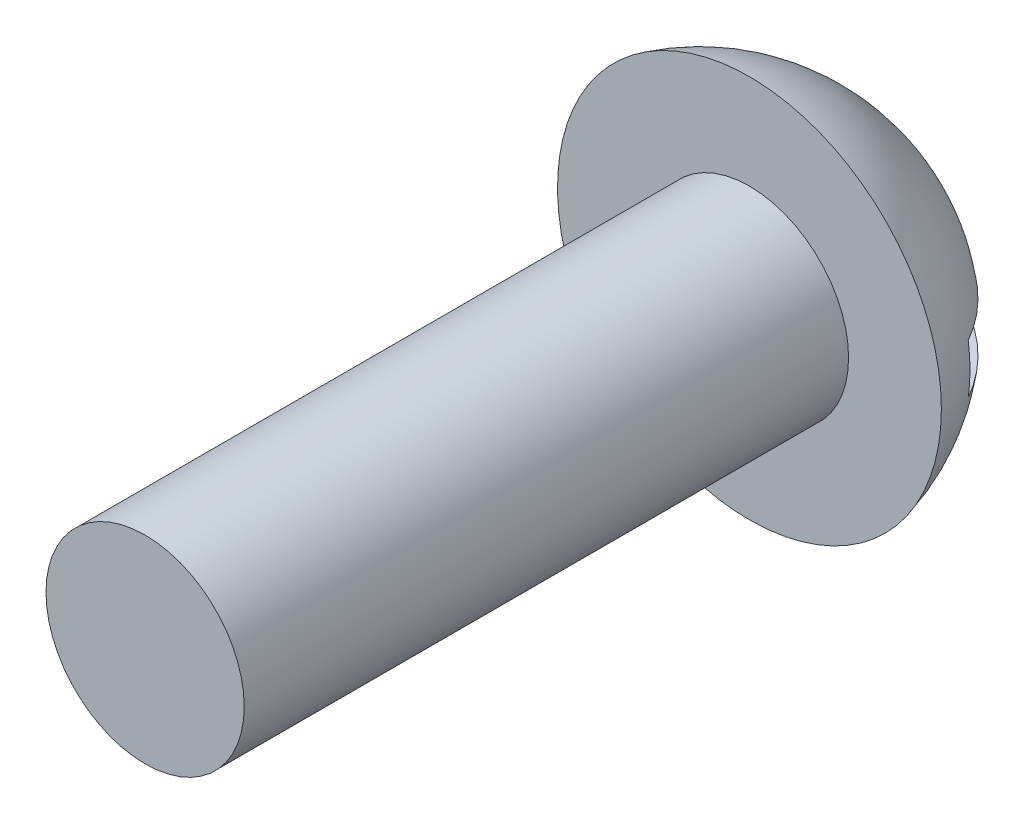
from build123d import *

# Parameters (mm, degrees)
SKETCH2_R           = 2.0828
BOSS_EXTRUDE1_DEPTH = 12.7
CUT_EXTRUDE1_DEPTH  = 41.667790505


with BuildPart() as part:
    # Sketch1 → Base-Revolve (revolve)
    with BuildSketch(Plane(origin=(0, 0, 0), x_dir=(0, 0, -1), z_dir=(1, 0, 0))):
        with BuildLine():
            Line((-22.86, 15.282157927), (-19.7358, 15.282157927))
            ThreePointArc((-19.7358, 15.282157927), (-20.608204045, 17.833056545), (-22.86, 19.315482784))
            Line((-22.86, 19.315482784), (-22.86, 15.282157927))
        make_face()
    revolve(axis=Axis((0, 15.282157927, 28.59405), (0, 0, -1)))

    # Sketch2 → Boss-Extrude1 (add)
    with BuildSketch(Plane.XY.offset(22.86)):
        with Locations(Location((0, 15.24, 0), (0, 0, 180))):
            Circle(SKETCH2_R)
    extrude(amount=BOSS_EXTRUDE1_DEPTH)

    # Sketch4 → Cut-Extrude1 (cut, through all)
    with BuildSketch(Plane(origin=(0, 0, 0), x_dir=(0, 0, -1), z_dir=(1, 0, 0))):
        with BuildLine():
            Line((-21.851271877, 14.761457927), (-19.768471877, 14.761457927))
            ThreePointArc((-19.768471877, 14.761457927), (-19.7358, 15.282157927), (-19.768471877, 15.802857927))
            Line((-19.768471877, 15.802857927), (-21.851271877, 15.802857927))
            Line((-21.851271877, 15.802857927), (-21.851271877, 14.761457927))
        make_face()
    cut_extrude1 = extrude(amount=-CUT_EXTRUDE1_DEPTH, mode=Mode.SUBTRACT)

    # Mirror1: Cut-Extrude1 across plane
    add(cut_extrude1.mirror(Plane(origin=(0, 15.282157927, 23.9014), x_dir=(0, 0, 1), z_dir=(1, 0, 0))), mode=Mode.SUBTRACT)


solid = part.part
